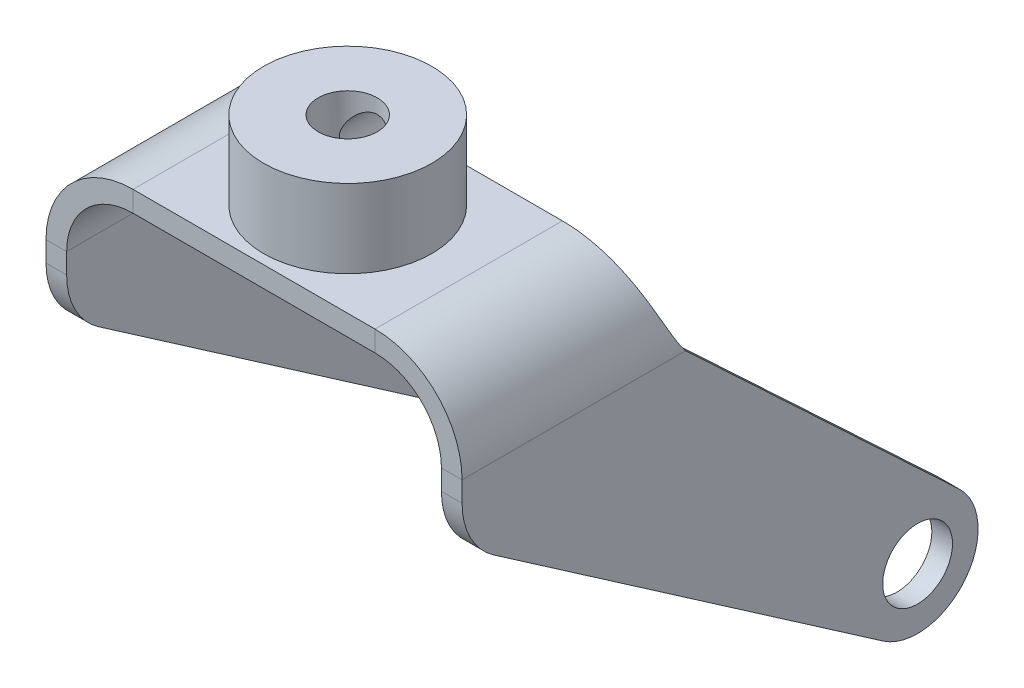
ISO-10303-21;
HEADER;
FILE_DESCRIPTION(('STEP AP214'),'2;1');
FILE_NAME('part.step','',(''),(''),'','','');
FILE_SCHEMA(('AUTOMOTIVE_DESIGN { 1 0 10303 214 1 1 1 1 }'));
ENDSEC;
DATA;
#1=APPLICATION_CONTEXT('core data for automotive mechanical design processes');
#2=APPLICATION_PROTOCOL_DEFINITION('international standard','automotive_design',2000,#1);
#3=PRODUCT_CONTEXT('',#1,'mechanical');
#4=PRODUCT('Part','Part','',(#3));
#5=PRODUCT_RELATED_PRODUCT_CATEGORY('part','',(#4));
#6=PRODUCT_DEFINITION_FORMATION('','',#4);
#7=PRODUCT_DEFINITION_CONTEXT('part definition',#1,'design');
#8=PRODUCT_DEFINITION('design','',#6,#7);
#9=PRODUCT_DEFINITION_SHAPE('','',#8);
#10=(LENGTH_UNIT() NAMED_UNIT(*) SI_UNIT(.MILLI.,.METRE.));
#11=(NAMED_UNIT(*) PLANE_ANGLE_UNIT() SI_UNIT($,.RADIAN.));
#12=(NAMED_UNIT(*) SI_UNIT($,.STERADIAN.) SOLID_ANGLE_UNIT());
#13=UNCERTAINTY_MEASURE_WITH_UNIT(LENGTH_MEASURE(1.E-05),#10,'distance_accuracy_value','');
#14=(GEOMETRIC_REPRESENTATION_CONTEXT(3) GLOBAL_UNCERTAINTY_ASSIGNED_CONTEXT((#13)) GLOBAL_UNIT_ASSIGNED_CONTEXT((#10,
#11,#12)) REPRESENTATION_CONTEXT('',''));
#15=CARTESIAN_POINT('',(0.,0.,0.));
#16=DIRECTION('',(0.,0.,1.));
#17=DIRECTION('',(1.,0.,0.));
#18=AXIS2_PLACEMENT_3D('',#15,#16,#17);
#19=CARTESIAN_POINT('',(-12.7,1.4,6.35));
#20=DIRECTION('',(0.,1.,0.));
#21=DIRECTION('',(0.,0.,1.));
#22=AXIS2_PLACEMENT_3D('',#19,#20,#21);
#23=PLANE('',#22);
#24=DIRECTION('',(1.,0.,0.));
#25=VECTOR('',#24,1.);
#26=CARTESIAN_POINT('',(-12.7,1.4,-6.35));
#27=LINE('',#26,#25);
#28=CARTESIAN_POINT('',(8.2,1.4,-6.35));
#29=VERTEX_POINT('',#28);
#30=CARTESIAN_POINT('',(-8.2,1.4,-6.35));
#31=VERTEX_POINT('',#30);
#32=EDGE_CURVE('E327',#29,#31,#27,.F.);
#33=ORIENTED_EDGE('',*,*,#32,.T.);
#34=DIRECTION('',(0.,0.,1.));
#35=VECTOR('',#34,1.);
#36=CARTESIAN_POINT('',(-8.2,1.4,6.35));
#37=LINE('',#36,#35);
#38=CARTESIAN_POINT('',(-8.2,1.4,6.35));
#39=VERTEX_POINT('',#38);
#40=EDGE_CURVE('E148',#39,#31,#37,.F.);
#41=ORIENTED_EDGE('',*,*,#40,.F.);
#42=DIRECTION('',(1.,0.,0.));
#43=VECTOR('',#42,1.);
#44=CARTESIAN_POINT('',(-12.7,1.4,6.35));
#45=LINE('',#44,#43);
#46=CARTESIAN_POINT('',(8.2,1.4,6.35));
#47=VERTEX_POINT('',#46);
#48=EDGE_CURVE('E329',#39,#47,#45,.T.);
#49=ORIENTED_EDGE('',*,*,#48,.T.);
#50=DIRECTION('',(0.,0.,1.));
#51=VECTOR('',#50,1.);
#52=CARTESIAN_POINT('',(8.2,1.4,6.35));
#53=LINE('',#52,#51);
#54=EDGE_CURVE('E325',#29,#47,#53,.T.);
#55=ORIENTED_EDGE('',*,*,#54,.F.);
#56=EDGE_LOOP('',(#33,#41,#49,#55));
#57=FACE_BOUND('',#56,.T.);
#58=CARTESIAN_POINT('',(0.,1.4,0.));
#59=DIRECTION('',(0.,1.,0.));
#60=DIRECTION('',(0.,0.,1.));
#61=AXIS2_PLACEMENT_3D('',#58,#59,#60);
#62=CIRCLE('',#61,5.7);
#63=CARTESIAN_POINT('',(0.,1.4,5.7));
#64=VERTEX_POINT('',#63);
#65=EDGE_CURVE('E540',#64,#64,#62,.T.);
#66=ORIENTED_EDGE('',*,*,#65,.F.);
#67=EDGE_LOOP('',(#66));
#68=FACE_BOUND('',#67,.T.);
#69=ADVANCED_FACE('F36',(#57,#68),#23,.T.);
#70=CARTESIAN_POINT('',(-12.7,0.,-6.35));
#71=DIRECTION('',(0.,0.,-1.));
#72=DIRECTION('',(-1.,0.,0.));
#73=AXIS2_PLACEMENT_3D('',#70,#71,#72);
#74=PLANE('',#73);
#75=CARTESIAN_POINT('',(-8.2,1.4,-6.35));
#76=CARTESIAN_POINT('',(-8.2,0.,-6.35));
#77=B_SPLINE_CURVE_WITH_KNOTS('',1,(#75,#76),.UNSPECIFIED.,.F.,.F.,(2,2),(0.,1.),.UNSPECIFIED.);
#78=CARTESIAN_POINT('',(-8.2,0.,-6.35));
#79=VERTEX_POINT('',#78);
#80=EDGE_CURVE('E11',#31,#79,#77,.T.);
#81=ORIENTED_EDGE('',*,*,#80,.F.);
#82=ORIENTED_EDGE('',*,*,#32,.F.);
#83=CARTESIAN_POINT('',(8.2,0.,-6.35));
#84=CARTESIAN_POINT('',(8.2,1.4,-6.35));
#85=B_SPLINE_CURVE_WITH_KNOTS('',1,(#83,#84),.UNSPECIFIED.,.F.,.F.,(2,2),(0.,1.),.UNSPECIFIED.);
#86=CARTESIAN_POINT('',(8.2,0.,-6.35));
#87=VERTEX_POINT('',#86);
#88=EDGE_CURVE('E50',#29,#87,#85,.F.);
#89=ORIENTED_EDGE('',*,*,#88,.T.);
#90=DIRECTION('',(-1.,0.,0.));
#91=VECTOR('',#90,1.);
#92=CARTESIAN_POINT('',(-12.7,0.,-6.35));
#93=LINE('',#92,#91);
#94=EDGE_CURVE('E454',#87,#79,#93,.T.);
#95=ORIENTED_EDGE('',*,*,#94,.T.);
#96=EDGE_LOOP('',(#81,#82,#89,#95));
#97=FACE_BOUND('',#96,.T.);
#98=ADVANCED_FACE('F186',(#97),#74,.T.);
#99=CARTESIAN_POINT('',(14.1,-4.5,-8.80259309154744));
#100=CARTESIAN_POINT('',(14.1,-4.24520518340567,-8.59536493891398));
#101=CARTESIAN_POINT('',(14.0833667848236,-3.95543061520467,-8.40151880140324));
#102=CARTESIAN_POINT('',(13.9911021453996,-3.3279520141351,-8.04067228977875));
#103=CARTESIAN_POINT('',(13.915269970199,-2.99020439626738,-7.87361291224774));
#104=CARTESIAN_POINT('',(13.6850177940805,-2.29582818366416,-7.56594962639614));
#105=CARTESIAN_POINT('',(13.5304514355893,-1.9393401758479,-7.42534571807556));
#106=CARTESIAN_POINT('',(13.1351058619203,-1.24186842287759,-7.17032108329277));
#107=CARTESIAN_POINT('',(12.8942854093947,-0.901100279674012,-7.05590035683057));
#108=CARTESIAN_POINT('',(12.3337687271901,-0.269119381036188,-6.8529697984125));
#109=CARTESIAN_POINT('',(12.0141603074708,0.0218727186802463,-6.76445996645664));
#110=CARTESIAN_POINT('',(11.3177211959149,0.52742143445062,-6.61307890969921));
#111=CARTESIAN_POINT('',(10.941085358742,0.741828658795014,-6.55020768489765));
#112=CARTESIAN_POINT('',(10.1621884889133,1.08033448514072,-6.44983155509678));
#113=CARTESIAN_POINT('',(9.76016549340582,1.20440477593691,-6.41232665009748));
#114=CARTESIAN_POINT('',(8.96526323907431,1.36418983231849,-6.36241087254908));
#115=CARTESIAN_POINT('',(8.57248287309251,1.4,-6.35));
#116=CARTESIAN_POINT('',(8.2,1.4,-6.35));
#117=CARTESIAN_POINT('',(12.7,-4.5,-8.80259309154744));
#118=CARTESIAN_POINT('',(12.7,-4.30565265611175,-8.59535180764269));
#119=CARTESIAN_POINT('',(12.6873136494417,-4.0846504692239,-8.40151880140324));
#120=CARTESIAN_POINT('',(12.6169423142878,-3.60606509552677,-8.04067228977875));
#121=CARTESIAN_POINT('',(12.5591042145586,-3.34846098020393,-7.87361291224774));
#122=CARTESIAN_POINT('',(12.3834881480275,-2.81885200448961,-7.56594962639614));
#123=CARTESIAN_POINT('',(12.2655985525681,-2.54695437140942,-7.42534571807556));
#124=CARTESIAN_POINT('',(11.9640637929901,-2.01498439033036,-7.17032108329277));
#125=CARTESIAN_POINT('',(11.7803871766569,-1.75507648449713,-7.05590035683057));
#126=CARTESIAN_POINT('',(11.3528744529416,-1.2730571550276,-6.8529697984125));
#127=CARTESIAN_POINT('',(11.1091053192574,-1.05111402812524,-6.76445996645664));
#128=CARTESIAN_POINT('',(10.5779229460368,-0.665526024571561,-6.61307890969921));
#129=CARTESIAN_POINT('',(10.2906583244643,-0.501995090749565,-6.55020768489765));
#130=CARTESIAN_POINT('',(9.69658444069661,-0.243812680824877,-6.44983155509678));
#131=CARTESIAN_POINT('',(9.38995673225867,-0.149182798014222,-6.41232665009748));
#132=CARTESIAN_POINT('',(8.78367535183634,-0.0273128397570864,-6.36241087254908));
#133=CARTESIAN_POINT('',(8.48409710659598,0.,-6.35));
#134=CARTESIAN_POINT('',(8.2,0.,-6.35));
#135=B_SPLINE_SURFACE_WITH_KNOTS('',1,3,((#99,#100,#101,#102,#103,#104,#105,#106,#107,#108,#109,
#110,#111,#112,#113,#114,#115,#116),(#117,#118,#119,#120,#121,#122,#123,#124,#125,#126,#127,
#128,#129,#130,#131,#132,#133,#134)),.UNSPECIFIED.,.F.,.F.,.F.,(2,2),(4,2,2,2,2,2,2,2,4),(0.,
1.),(0.,0.125,0.25,0.375,0.5,0.625,0.75,0.875,1.),.UNSPECIFIED.);
#136=CARTESIAN_POINT('',(8.2,1.4,-6.35));
#137=CARTESIAN_POINT('',(8.57248287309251,1.4,-6.35));
#138=CARTESIAN_POINT('',(8.96526323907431,1.36418983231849,-6.36241087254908));
#139=CARTESIAN_POINT('',(9.76016549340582,1.20440477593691,-6.41232665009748));
#140=CARTESIAN_POINT('',(10.1621884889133,1.08033448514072,-6.44983155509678));
#141=CARTESIAN_POINT('',(10.941085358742,0.741828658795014,-6.55020768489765));
#142=CARTESIAN_POINT('',(11.3177211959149,0.52742143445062,-6.61307890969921));
#143=CARTESIAN_POINT('',(12.0141603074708,0.0218727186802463,-6.76445996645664));
#144=CARTESIAN_POINT('',(12.3337687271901,-0.269119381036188,-6.8529697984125));
#145=CARTESIAN_POINT('',(12.8942854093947,-0.901100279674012,-7.05590035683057));
#146=CARTESIAN_POINT('',(13.1351058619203,-1.24186842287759,-7.17032108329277));
#147=CARTESIAN_POINT('',(13.5304514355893,-1.9393401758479,-7.42534571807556));
#148=CARTESIAN_POINT('',(13.6850177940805,-2.29582818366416,-7.56594962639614));
#149=CARTESIAN_POINT('',(13.915269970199,-2.99020439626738,-7.87361291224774));
#150=CARTESIAN_POINT('',(13.9911021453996,-3.3279520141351,-8.04067228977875));
#151=CARTESIAN_POINT('',(14.0833667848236,-3.95543061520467,-8.40151880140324));
#152=CARTESIAN_POINT('',(14.1,-4.24520518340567,-8.59536493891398));
#153=CARTESIAN_POINT('',(14.1,-4.5,-8.80259309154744));
#154=B_SPLINE_CURVE_WITH_KNOTS('',3,(#136,#137,#138,#139,#140,#141,#142,#143,#144,#145,#146,
#147,#148,#149,#150,#151,#152,#153),.UNSPECIFIED.,.F.,.F.,(4,2,2,2,2,2,2,2,4),(0.,0.125,0.25,
0.375,0.5,0.625,0.75,0.875,1.),.UNSPECIFIED.);
#155=CARTESIAN_POINT('',(14.1,-4.5,-8.80259309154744));
#156=VERTEX_POINT('',#155);
#157=EDGE_CURVE('E315',#29,#156,#154,.T.);
#158=CARTESIAN_POINT('',(14.1,-4.5,-8.80259309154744));
#159=CARTESIAN_POINT('',(12.7,-4.5,-8.80259309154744));
#160=B_SPLINE_CURVE_WITH_KNOTS('',1,(#158,#159),.UNSPECIFIED.,.F.,.F.,(2,2),(0.,1.),.UNSPECIFIED.);
#161=CARTESIAN_POINT('',(12.7,-4.5,-8.80259309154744));
#162=VERTEX_POINT('',#161);
#163=EDGE_CURVE('E321',#156,#162,#160,.T.);
#164=CARTESIAN_POINT('',(12.7,-4.5,-8.80259309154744));
#165=CARTESIAN_POINT('',(12.7,-4.30565265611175,-8.59535180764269));
#166=CARTESIAN_POINT('',(12.6873136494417,-4.0846504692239,-8.40151880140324));
#167=CARTESIAN_POINT('',(12.6169423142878,-3.60606509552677,-8.04067228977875));
#168=CARTESIAN_POINT('',(12.5591042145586,-3.34846098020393,-7.87361291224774));
#169=CARTESIAN_POINT('',(12.3834881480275,-2.81885200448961,-7.56594962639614));
#170=CARTESIAN_POINT('',(12.2655985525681,-2.54695437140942,-7.42534571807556));
#171=CARTESIAN_POINT('',(11.9640637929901,-2.01498439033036,-7.17032108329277));
#172=CARTESIAN_POINT('',(11.7803871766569,-1.75507648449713,-7.05590035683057));
#173=CARTESIAN_POINT('',(11.3528744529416,-1.2730571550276,-6.8529697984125));
#174=CARTESIAN_POINT('',(11.1091053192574,-1.05111402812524,-6.76445996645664));
#175=CARTESIAN_POINT('',(10.5779229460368,-0.665526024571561,-6.61307890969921));
#176=CARTESIAN_POINT('',(10.2906583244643,-0.501995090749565,-6.55020768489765));
#177=CARTESIAN_POINT('',(9.69658444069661,-0.243812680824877,-6.44983155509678));
#178=CARTESIAN_POINT('',(9.38995673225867,-0.149182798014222,-6.41232665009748));
#179=CARTESIAN_POINT('',(8.78367535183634,-0.0273128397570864,-6.36241087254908));
#180=CARTESIAN_POINT('',(8.48409710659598,0.,-6.35));
#181=CARTESIAN_POINT('',(8.2,0.,-6.35));
#182=B_SPLINE_CURVE_WITH_KNOTS('',3,(#164,#165,#166,#167,#168,#169,#170,#171,#172,#173,#174,
#175,#176,#177,#178,#179,#180,#181),.UNSPECIFIED.,.F.,.F.,(4,2,2,2,2,2,2,2,4),(0.,0.125,0.25,
0.375,0.5,0.625,0.75,0.875,1.),.UNSPECIFIED.);
#183=EDGE_CURVE('E318',#87,#162,#182,.F.);
#184=ORIENTED_EDGE('',*,*,#88,.F.);
#185=ORIENTED_EDGE('',*,*,#157,.T.);
#186=ORIENTED_EDGE('',*,*,#163,.T.);
#187=ORIENTED_EDGE('',*,*,#183,.F.);
#188=EDGE_LOOP('',(#184,#185,#186,#187));
#189=FACE_BOUND('',#188,.T.);
#190=ADVANCED_FACE('F278',(#189),#135,.T.);
#191=CARTESIAN_POINT('',(12.7,-2.2,-6.35));
#192=DIRECTION('',(0.,0.729434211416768,-0.684050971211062));
#193=DIRECTION('',(0.,0.684050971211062,0.729434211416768));
#194=AXIS2_PLACEMENT_3D('',#191,#192,#193);
#195=PLANE('',#194);
#196=ORIENTED_EDGE('',*,*,#163,.F.);
#197=DIRECTION('',(0.,0.684050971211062,0.729434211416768));
#198=VECTOR('',#197,1.);
#199=CARTESIAN_POINT('',(14.1,-2.2,-6.35));
#200=LINE('',#199,#198);
#201=CARTESIAN_POINT('',(14.1,-21.8743197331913,-27.3296089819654));
#202=VERTEX_POINT('',#201);
#203=EDGE_CURVE('E349',#202,#156,#200,.T.);
#204=ORIENTED_EDGE('',*,*,#203,.F.);
#205=DIRECTION('',(-1.,0.,0.));
#206=VECTOR('',#205,1.);
#207=CARTESIAN_POINT('',(12.7,-21.8743197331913,-27.3296089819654));
#208=LINE('',#207,#206);
#209=CARTESIAN_POINT('',(12.7,-21.8743197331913,-27.3296089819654));
#210=VERTEX_POINT('',#209);
#211=EDGE_CURVE('E513',#202,#210,#208,.T.);
#212=ORIENTED_EDGE('',*,*,#211,.T.);
#213=DIRECTION('',(0.,0.684050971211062,0.729434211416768));
#214=VECTOR('',#213,1.);
#215=CARTESIAN_POINT('',(12.7,-2.2,-6.35));
#216=LINE('',#215,#214);
#217=EDGE_CURVE('E408',#210,#162,#216,.T.);
#218=ORIENTED_EDGE('',*,*,#217,.T.);
#219=EDGE_LOOP('',(#196,#204,#212,#218));
#220=FACE_BOUND('',#219,.T.);
#221=ADVANCED_FACE('F274',(#220),#195,.T.);
#222=CARTESIAN_POINT('',(12.7,-24.865,-24.525));
#223=DIRECTION('',(1.,0.,0.));
#224=DIRECTION('',(0.,0.,-1.));
#225=AXIS2_PLACEMENT_3D('',#222,#223,#224);
#226=CYLINDRICAL_SURFACE('',#225,4.09999999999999);
#227=ORIENTED_EDGE('',*,*,#211,.F.);
#228=CARTESIAN_POINT('',(14.1,-24.865,-24.525));
#229=DIRECTION('',(1.,0.,0.));
#230=DIRECTION('',(0.,0.,-1.));
#231=AXIS2_PLACEMENT_3D('',#228,#229,#230);
#232=CIRCLE('',#231,4.09999999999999);
#233=CARTESIAN_POINT('',(14.1,-28.237277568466,-22.1931029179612));
#234=VERTEX_POINT('',#233);
#235=EDGE_CURVE('E344',#234,#202,#232,.T.);
#236=ORIENTED_EDGE('',*,*,#235,.F.);
#237=DIRECTION('',(-1.,0.,0.));
#238=VECTOR('',#237,1.);
#239=CARTESIAN_POINT('',(12.7,-28.237277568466,-22.1931029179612));
#240=LINE('',#239,#238);
#241=CARTESIAN_POINT('',(12.7,-28.237277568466,-22.1931029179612));
#242=VERTEX_POINT('',#241);
#243=EDGE_CURVE('E510',#234,#242,#240,.T.);
#244=ORIENTED_EDGE('',*,*,#243,.T.);
#245=CARTESIAN_POINT('',(12.7,-24.865,-24.525));
#246=DIRECTION('',(1.,0.,0.));
#247=DIRECTION('',(0.,0.,-1.));
#248=AXIS2_PLACEMENT_3D('',#245,#246,#247);
#249=CIRCLE('',#248,4.09999999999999);
#250=EDGE_CURVE('E456',#242,#210,#249,.T.);
#251=ORIENTED_EDGE('',*,*,#250,.T.);
#252=EDGE_LOOP('',(#227,#236,#244,#251));
#253=FACE_BOUND('',#252,.T.);
#254=ADVANCED_FACE('F270',(#253),#226,.T.);
#255=CARTESIAN_POINT('',(12.7,-8.5,6.35));
#256=DIRECTION('',(0.,-0.822506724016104,0.568755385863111));
#257=DIRECTION('',(0.,-0.568755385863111,-0.822506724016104));
#258=AXIS2_PLACEMENT_3D('',#255,#256,#257);
#259=PLANE('',#258);
#260=ORIENTED_EDGE('',*,*,#243,.F.);
#261=DIRECTION('',(0.,-0.568755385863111,-0.822506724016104));
#262=VECTOR('',#261,1.);
#263=CARTESIAN_POINT('',(14.1,-8.5,6.35));
#264=LINE('',#263,#262);
#265=CARTESIAN_POINT('',(14.1,-9.99100724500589,4.19377692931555));
#266=VERTEX_POINT('',#265);
#267=EDGE_CURVE('E604',#266,#234,#264,.T.);
#268=ORIENTED_EDGE('',*,*,#267,.F.);
#269=DIRECTION('',(-1.,0.,0.));
#270=VECTOR('',#269,1.);
#271=CARTESIAN_POINT('',(12.7,-9.99100724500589,4.19377692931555));
#272=LINE('',#271,#270);
#273=CARTESIAN_POINT('',(12.7,-9.99100724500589,4.19377692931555));
#274=VERTEX_POINT('',#273);
#275=EDGE_CURVE('E507',#266,#274,#272,.T.);
#276=ORIENTED_EDGE('',*,*,#275,.T.);
#277=DIRECTION('',(0.,-0.568755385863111,-0.822506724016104));
#278=VECTOR('',#277,1.);
#279=CARTESIAN_POINT('',(12.7,-8.5,6.35));
#280=LINE('',#279,#278);
#281=EDGE_CURVE('E530',#274,#242,#280,.T.);
#282=ORIENTED_EDGE('',*,*,#281,.T.);
#283=EDGE_LOOP('',(#260,#268,#276,#282));
#284=FACE_BOUND('',#283,.T.);
#285=ADVANCED_FACE('F266',(#284),#259,.T.);
#286=CARTESIAN_POINT('',(12.7,-5.87847362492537,1.35));
#287=DIRECTION('',(1.,0.,0.));
#288=DIRECTION('',(0.,0.,-1.));
#289=AXIS2_PLACEMENT_3D('',#286,#287,#288);
#290=CYLINDRICAL_SURFACE('',#289,5.);
#291=ORIENTED_EDGE('',*,*,#275,.F.);
#292=CARTESIAN_POINT('',(14.1,-5.87847362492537,1.35));
#293=DIRECTION('',(1.,0.,0.));
#294=DIRECTION('',(0.,0.,-1.));
#295=AXIS2_PLACEMENT_3D('',#292,#293,#294);
#296=CIRCLE('',#295,5.);
#297=CARTESIAN_POINT('',(14.1,-5.87847362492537,6.35));
#298=VERTEX_POINT('',#297);
#299=EDGE_CURVE('E601',#266,#298,#296,.F.);
#300=ORIENTED_EDGE('',*,*,#299,.T.);
#301=DIRECTION('',(-1.,0.,0.));
#302=VECTOR('',#301,1.);
#303=CARTESIAN_POINT('',(12.7,-5.87847362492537,6.35));
#304=LINE('',#303,#302);
#305=CARTESIAN_POINT('',(12.7,-5.87847362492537,6.35));
#306=VERTEX_POINT('',#305);
#307=EDGE_CURVE('E504',#298,#306,#304,.T.);
#308=ORIENTED_EDGE('',*,*,#307,.T.);
#309=CARTESIAN_POINT('',(12.7,-5.87847362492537,1.35));
#310=DIRECTION('',(1.,0.,0.));
#311=DIRECTION('',(0.,0.,-1.));
#312=AXIS2_PLACEMENT_3D('',#309,#310,#311);
#313=CIRCLE('',#312,5.);
#314=EDGE_CURVE('E527',#274,#306,#313,.F.);
#315=ORIENTED_EDGE('',*,*,#314,.F.);
#316=EDGE_LOOP('',(#291,#300,#308,#315));
#317=FACE_BOUND('',#316,.T.);
#318=ADVANCED_FACE('F262',(#317),#290,.T.);
#319=CARTESIAN_POINT('',(12.7,1.4,6.35));
#320=DIRECTION('',(0.,0.,1.));
#321=DIRECTION('',(0.,-1.,0.));
#322=AXIS2_PLACEMENT_3D('',#319,#320,#321);
#323=PLANE('',#322);
#324=ORIENTED_EDGE('',*,*,#307,.F.);
#325=DIRECTION('',(0.,1.,0.));
#326=VECTOR('',#325,1.);
#327=CARTESIAN_POINT('',(14.1,-24.865,6.35));
#328=LINE('',#327,#326);
#329=CARTESIAN_POINT('',(14.1,-4.5,6.35));
#330=VERTEX_POINT('',#329);
#331=EDGE_CURVE('E598',#330,#298,#328,.F.);
#332=ORIENTED_EDGE('',*,*,#331,.F.);
#333=DIRECTION('',(-1.,0.,0.));
#334=VECTOR('',#333,1.);
#335=CARTESIAN_POINT('',(12.7,-4.5,6.35));
#336=LINE('',#335,#334);
#337=CARTESIAN_POINT('',(12.7,-4.5,6.35));
#338=VERTEX_POINT('',#337);
#339=EDGE_CURVE('E501',#330,#338,#336,.T.);
#340=ORIENTED_EDGE('',*,*,#339,.T.);
#341=DIRECTION('',(0.,-1.,0.));
#342=VECTOR('',#341,1.);
#343=CARTESIAN_POINT('',(12.7,1.4,6.35));
#344=LINE('',#343,#342);
#345=EDGE_CURVE('E466',#338,#306,#344,.T.);
#346=ORIENTED_EDGE('',*,*,#345,.T.);
#347=EDGE_LOOP('',(#324,#332,#340,#346));
#348=FACE_BOUND('',#347,.T.);
#349=ADVANCED_FACE('F258',(#348),#323,.T.);
#350=CARTESIAN_POINT('',(8.2,-4.5,6.35));
#351=DIRECTION('',(0.,0.,1.));
#352=DIRECTION('',(0.,-1.,0.));
#353=AXIS2_PLACEMENT_3D('',#350,#351,#352);
#354=PLANE('',#353);
#355=ORIENTED_EDGE('',*,*,#339,.F.);
#356=CARTESIAN_POINT('',(8.2,-4.5,6.35));
#357=DIRECTION('',(0.,0.,1.));
#358=DIRECTION('',(1.,0.,0.));
#359=AXIS2_PLACEMENT_3D('',#356,#357,#358);
#360=CIRCLE('',#359,5.9);
#361=EDGE_CURVE('E340',#330,#47,#360,.T.);
#362=ORIENTED_EDGE('',*,*,#361,.T.);
#363=DIRECTION('',(0.,-1.,0.));
#364=VECTOR('',#363,1.);
#365=CARTESIAN_POINT('',(8.2,0.,6.35));
#366=LINE('',#365,#364);
#367=CARTESIAN_POINT('',(8.2,0.,6.35));
#368=VERTEX_POINT('',#367);
#369=EDGE_CURVE('E484',#47,#368,#366,.T.);
#370=ORIENTED_EDGE('',*,*,#369,.T.);
#371=CARTESIAN_POINT('',(8.2,-4.5,6.35));
#372=DIRECTION('',(0.,0.,-1.));
#373=DIRECTION('',(0.,1.,0.));
#374=AXIS2_PLACEMENT_3D('',#371,#372,#373);
#375=CIRCLE('',#374,4.5);
#376=EDGE_CURVE('E469',#338,#368,#375,.F.);
#377=ORIENTED_EDGE('',*,*,#376,.F.);
#378=EDGE_LOOP('',(#355,#362,#370,#377));
#379=FACE_BOUND('',#378,.T.);
#380=ADVANCED_FACE('F254',(#379),#354,.T.);
#381=CARTESIAN_POINT('',(-12.7,0.,6.35));
#382=DIRECTION('',(0.,0.,1.));
#383=DIRECTION('',(1.,0.,0.));
#384=AXIS2_PLACEMENT_3D('',#381,#382,#383);
#385=PLANE('',#384);
#386=ORIENTED_EDGE('',*,*,#369,.F.);
#387=ORIENTED_EDGE('',*,*,#48,.F.);
#388=DIRECTION('',(0.,-1.,0.));
#389=VECTOR('',#388,1.);
#390=CARTESIAN_POINT('',(-8.2,0.,6.35));
#391=LINE('',#390,#389);
#392=CARTESIAN_POINT('',(-8.2,0.,6.35));
#393=VERTEX_POINT('',#392);
#394=EDGE_CURVE('E485',#39,#393,#391,.T.);
#395=ORIENTED_EDGE('',*,*,#394,.T.);
#396=DIRECTION('',(1.,0.,0.));
#397=VECTOR('',#396,1.);
#398=CARTESIAN_POINT('',(-12.7,0.,6.35));
#399=LINE('',#398,#397);
#400=EDGE_CURVE('E455',#393,#368,#399,.T.);
#401=ORIENTED_EDGE('',*,*,#400,.T.);
#402=EDGE_LOOP('',(#386,#387,#395,#401));
#403=FACE_BOUND('',#402,.T.);
#404=ADVANCED_FACE('F250',(#403),#385,.T.);
#405=CARTESIAN_POINT('',(-8.2,-4.5,6.35));
#406=DIRECTION('',(0.,0.,1.));
#407=DIRECTION('',(0.,-1.,0.));
#408=AXIS2_PLACEMENT_3D('',#405,#406,#407);
#409=PLANE('',#408);
#410=ORIENTED_EDGE('',*,*,#394,.F.);
#411=CARTESIAN_POINT('',(-8.2,-4.5,6.35));
#412=DIRECTION('',(0.,0.,-1.));
#413=DIRECTION('',(-1.,0.,0.));
#414=AXIS2_PLACEMENT_3D('',#411,#412,#413);
#415=CIRCLE('',#414,5.9);
#416=CARTESIAN_POINT('',(-14.1,-4.5,6.35000000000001));
#417=VERTEX_POINT('',#416);
#418=EDGE_CURVE('E155',#39,#417,#415,.F.);
#419=ORIENTED_EDGE('',*,*,#418,.T.);
#420=DIRECTION('',(1.,0.,0.));
#421=VECTOR('',#420,1.);
#422=CARTESIAN_POINT('',(-12.7,-4.5,6.35000000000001));
#423=LINE('',#422,#421);
#424=CARTESIAN_POINT('',(-12.7,-4.5,6.35000000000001));
#425=VERTEX_POINT('',#424);
#426=EDGE_CURVE('E489',#417,#425,#423,.T.);
#427=ORIENTED_EDGE('',*,*,#426,.T.);
#428=CARTESIAN_POINT('',(-8.2,-4.5,6.35));
#429=DIRECTION('',(0.,0.,-1.));
#430=DIRECTION('',(0.,1.,0.));
#431=AXIS2_PLACEMENT_3D('',#428,#429,#430);
#432=CIRCLE('',#431,4.5);
#433=EDGE_CURVE('E453',#393,#425,#432,.F.);
#434=ORIENTED_EDGE('',*,*,#433,.F.);
#435=EDGE_LOOP('',(#410,#419,#427,#434));
#436=FACE_BOUND('',#435,.T.);
#437=ADVANCED_FACE('F246',(#436),#409,.T.);
#438=CARTESIAN_POINT('',(-12.7,-8.5,6.35000000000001));
#439=DIRECTION('',(0.,0.,1.));
#440=DIRECTION('',(0.,1.,0.));
#441=AXIS2_PLACEMENT_3D('',#438,#439,#440);
#442=PLANE('',#441);
#443=ORIENTED_EDGE('',*,*,#426,.F.);
#444=DIRECTION('',(0.,1.,0.));
#445=VECTOR('',#444,1.);
#446=CARTESIAN_POINT('',(-14.1,-24.865,6.35000000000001));
#447=LINE('',#446,#445);
#448=CARTESIAN_POINT('',(-14.1,-5.87847362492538,6.35000000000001));
#449=VERTEX_POINT('',#448);
#450=EDGE_CURVE('E144',#449,#417,#447,.T.);
#451=ORIENTED_EDGE('',*,*,#450,.F.);
#452=DIRECTION('',(1.,0.,0.));
#453=VECTOR('',#452,1.);
#454=CARTESIAN_POINT('',(-12.7,-5.87847362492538,6.35000000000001));
#455=LINE('',#454,#453);
#456=CARTESIAN_POINT('',(-12.7,-5.87847362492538,6.35000000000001));
#457=VERTEX_POINT('',#456);
#458=EDGE_CURVE('E492',#449,#457,#455,.T.);
#459=ORIENTED_EDGE('',*,*,#458,.T.);
#460=DIRECTION('',(0.,1.,0.));
#461=VECTOR('',#460,1.);
#462=CARTESIAN_POINT('',(-12.7,-8.5,6.35000000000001));
#463=LINE('',#462,#461);
#464=EDGE_CURVE('E648',#457,#425,#463,.T.);
#465=ORIENTED_EDGE('',*,*,#464,.T.);
#466=EDGE_LOOP('',(#443,#451,#459,#465));
#467=FACE_BOUND('',#466,.T.);
#468=ADVANCED_FACE('F242',(#467),#442,.T.);
#469=CARTESIAN_POINT('',(-12.7,-5.87847362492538,1.35));
#470=DIRECTION('',(-1.,0.,0.));
#471=DIRECTION('',(0.,0.,1.));
#472=AXIS2_PLACEMENT_3D('',#469,#470,#471);
#473=CYLINDRICAL_SURFACE('',#472,5.);
#474=ORIENTED_EDGE('',*,*,#458,.F.);
#475=CARTESIAN_POINT('',(-14.1,-5.87847362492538,1.35));
#476=DIRECTION('',(-1.,0.,0.));
#477=DIRECTION('',(0.,0.,1.));
#478=AXIS2_PLACEMENT_3D('',#475,#476,#477);
#479=CIRCLE('',#478,5.);
#480=CARTESIAN_POINT('',(-14.1,-9.9910072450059,4.19377692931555));
#481=VERTEX_POINT('',#480);
#482=EDGE_CURVE('E632',#449,#481,#479,.F.);
#483=ORIENTED_EDGE('',*,*,#482,.T.);
#484=DIRECTION('',(1.,0.,0.));
#485=VECTOR('',#484,1.);
#486=CARTESIAN_POINT('',(-12.7,-9.9910072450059,4.19377692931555));
#487=LINE('',#486,#485);
#488=CARTESIAN_POINT('',(-12.7,-9.9910072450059,4.19377692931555));
#489=VERTEX_POINT('',#488);
#490=EDGE_CURVE('E496',#481,#489,#487,.T.);
#491=ORIENTED_EDGE('',*,*,#490,.T.);
#492=CARTESIAN_POINT('',(-12.7,-5.87847362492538,1.35));
#493=DIRECTION('',(-1.,0.,0.));
#494=DIRECTION('',(0.,0.,1.));
#495=AXIS2_PLACEMENT_3D('',#492,#493,#494);
#496=CIRCLE('',#495,5.);
#497=EDGE_CURVE('E649',#457,#489,#496,.F.);
#498=ORIENTED_EDGE('',*,*,#497,.F.);
#499=EDGE_LOOP('',(#474,#483,#491,#498));
#500=FACE_BOUND('',#499,.T.);
#501=ADVANCED_FACE('F238',(#500),#473,.T.);
#502=CARTESIAN_POINT('',(-12.7,-28.237277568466,-22.1931029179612));
#503=DIRECTION('',(0.,-0.822506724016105,0.568755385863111));
#504=DIRECTION('',(0.,0.568755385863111,0.822506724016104));
#505=AXIS2_PLACEMENT_3D('',#502,#503,#504);
#506=PLANE('',#505);
#507=ORIENTED_EDGE('',*,*,#490,.F.);
#508=DIRECTION('',(0.,0.568755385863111,0.822506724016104));
#509=VECTOR('',#508,1.);
#510=CARTESIAN_POINT('',(-14.1,-28.237277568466,-22.1931029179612));
#511=LINE('',#510,#509);
#512=CARTESIAN_POINT('',(-14.1,-28.237277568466,-22.1931029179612));
#513=VERTEX_POINT('',#512);
#514=EDGE_CURVE('E163',#513,#481,#511,.T.);
#515=ORIENTED_EDGE('',*,*,#514,.F.);
#516=DIRECTION('',(1.,0.,0.));
#517=VECTOR('',#516,1.);
#518=CARTESIAN_POINT('',(-12.7,-28.237277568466,-22.1931029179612));
#519=LINE('',#518,#517);
#520=CARTESIAN_POINT('',(-12.7,-28.237277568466,-22.1931029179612));
#521=VERTEX_POINT('',#520);
#522=EDGE_CURVE('E659',#513,#521,#519,.T.);
#523=ORIENTED_EDGE('',*,*,#522,.T.);
#524=DIRECTION('',(0.,0.568755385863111,0.822506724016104));
#525=VECTOR('',#524,1.);
#526=CARTESIAN_POINT('',(-12.7,-28.237277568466,-22.1931029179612));
#527=LINE('',#526,#525);
#528=EDGE_CURVE('E651',#521,#489,#527,.T.);
#529=ORIENTED_EDGE('',*,*,#528,.T.);
#530=EDGE_LOOP('',(#507,#515,#523,#529));
#531=FACE_BOUND('',#530,.T.);
#532=ADVANCED_FACE('F234',(#531),#506,.T.);
#533=CARTESIAN_POINT('',(-12.7,-24.865,-24.525));
#534=DIRECTION('',(-1.,0.,0.));
#535=DIRECTION('',(0.,0.,1.));
#536=AXIS2_PLACEMENT_3D('',#533,#534,#535);
#537=CYLINDRICAL_SURFACE('',#536,4.09999999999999);
#538=ORIENTED_EDGE('',*,*,#522,.F.);
#539=CARTESIAN_POINT('',(-14.1,-24.865,-24.525));
#540=DIRECTION('',(-1.,0.,0.));
#541=DIRECTION('',(0.,0.,1.));
#542=AXIS2_PLACEMENT_3D('',#539,#540,#541);
#543=CIRCLE('',#542,4.09999999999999);
#544=CARTESIAN_POINT('',(-14.1,-21.8743197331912,-27.3296089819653));
#545=VERTEX_POINT('',#544);
#546=EDGE_CURVE('E161',#545,#513,#543,.T.);
#547=ORIENTED_EDGE('',*,*,#546,.F.);
#548=DIRECTION('',(1.,0.,0.));
#549=VECTOR('',#548,1.);
#550=CARTESIAN_POINT('',(-12.7,-21.8743197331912,-27.3296089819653));
#551=LINE('',#550,#549);
#552=CARTESIAN_POINT('',(-12.7,-21.8743197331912,-27.3296089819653));
#553=VERTEX_POINT('',#552);
#554=EDGE_CURVE('E131',#545,#553,#551,.T.);
#555=ORIENTED_EDGE('',*,*,#554,.T.);
#556=CARTESIAN_POINT('',(-12.7,-24.865,-24.525));
#557=DIRECTION('',(-1.,0.,0.));
#558=DIRECTION('',(0.,0.,1.));
#559=AXIS2_PLACEMENT_3D('',#556,#557,#558);
#560=CIRCLE('',#559,4.09999999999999);
#561=EDGE_CURVE('E443',#553,#521,#560,.T.);
#562=ORIENTED_EDGE('',*,*,#561,.T.);
#563=EDGE_LOOP('',(#538,#547,#555,#562));
#564=FACE_BOUND('',#563,.T.);
#565=ADVANCED_FACE('F230',(#564),#537,.T.);
#566=CARTESIAN_POINT('',(-12.7,-2.2,-6.34999999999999));
#567=DIRECTION('',(0.,0.729434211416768,-0.684050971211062));
#568=DIRECTION('',(0.,-0.684050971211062,-0.729434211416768));
#569=AXIS2_PLACEMENT_3D('',#566,#567,#568);
#570=PLANE('',#569);
#571=ORIENTED_EDGE('',*,*,#554,.F.);
#572=DIRECTION('',(0.,-0.684050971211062,-0.729434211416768));
#573=VECTOR('',#572,1.);
#574=CARTESIAN_POINT('',(-14.1,-2.2,-6.34999999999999));
#575=LINE('',#574,#573);
#576=CARTESIAN_POINT('',(-14.1,-4.5,-8.80259309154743));
#577=VERTEX_POINT('',#576);
#578=EDGE_CURVE('E141',#577,#545,#575,.T.);
#579=ORIENTED_EDGE('',*,*,#578,.F.);
#580=CARTESIAN_POINT('',(-12.7,-4.5,-8.80259309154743));
#581=CARTESIAN_POINT('',(-14.1,-4.5,-8.80259309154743));
#582=B_SPLINE_CURVE_WITH_KNOTS('',1,(#580,#581),.UNSPECIFIED.,.F.,.F.,(2,2),(0.,1.),.UNSPECIFIED.);
#583=CARTESIAN_POINT('',(-12.7,-4.5,-8.80259309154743));
#584=VERTEX_POINT('',#583);
#585=EDGE_CURVE('E115',#577,#584,#582,.F.);
#586=ORIENTED_EDGE('',*,*,#585,.T.);
#587=DIRECTION('',(0.,-0.684050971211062,-0.729434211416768));
#588=VECTOR('',#587,1.);
#589=CARTESIAN_POINT('',(-12.7,-2.2,-6.34999999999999));
#590=LINE('',#589,#588);
#591=EDGE_CURVE('E437',#584,#553,#590,.T.);
#592=ORIENTED_EDGE('',*,*,#591,.T.);
#593=EDGE_LOOP('',(#571,#579,#586,#592));
#594=FACE_BOUND('',#593,.T.);
#595=ADVANCED_FACE('F158',(#594),#570,.T.);
#596=CARTESIAN_POINT('',(12.7,-24.865,-24.525));
#597=DIRECTION('',(1.,0.,0.));
#598=DIRECTION('',(0.,0.,-1.));
#599=AXIS2_PLACEMENT_3D('',#596,#597,#598);
#600=CYLINDRICAL_SURFACE('',#599,2.365);
#601=CARTESIAN_POINT('',(12.7,-24.865,-24.525));
#602=DIRECTION('',(1.,0.,0.));
#603=DIRECTION('',(0.,0.,-1.));
#604=AXIS2_PLACEMENT_3D('',#601,#602,#603);
#605=CIRCLE('',#604,2.365);
#606=CARTESIAN_POINT('',(12.7,-24.865,-26.89));
#607=VERTEX_POINT('',#606);
#608=EDGE_CURVE('E452',#607,#607,#605,.T.);
#609=ORIENTED_EDGE('',*,*,#608,.F.);
#610=EDGE_LOOP('',(#609));
#611=FACE_BOUND('',#610,.T.);
#612=CARTESIAN_POINT('',(14.1,-24.865,-24.525));
#613=DIRECTION('',(1.,0.,0.));
#614=DIRECTION('',(0.,0.,-1.));
#615=AXIS2_PLACEMENT_3D('',#612,#613,#614);
#616=CIRCLE('',#615,2.365);
#617=CARTESIAN_POINT('',(14.1,-24.865,-26.89));
#618=VERTEX_POINT('',#617);
#619=EDGE_CURVE('E154',#618,#618,#616,.T.);
#620=ORIENTED_EDGE('',*,*,#619,.T.);
#621=EDGE_LOOP('',(#620));
#622=FACE_BOUND('',#621,.T.);
#623=ADVANCED_FACE('F38',(#611,#622),#600,.F.);
#624=CARTESIAN_POINT('',(-12.7,-24.865,-24.525));
#625=DIRECTION('',(-1.,0.,0.));
#626=DIRECTION('',(0.,0.,1.));
#627=AXIS2_PLACEMENT_3D('',#624,#625,#626);
#628=CYLINDRICAL_SURFACE('',#627,2.365);
#629=CARTESIAN_POINT('',(-12.7,-24.865,-24.525));
#630=DIRECTION('',(-1.,0.,0.));
#631=DIRECTION('',(0.,0.,1.));
#632=AXIS2_PLACEMENT_3D('',#629,#630,#631);
#633=CIRCLE('',#632,2.365);
#634=CARTESIAN_POINT('',(-12.7,-24.865,-22.16));
#635=VERTEX_POINT('',#634);
#636=EDGE_CURVE('E459',#635,#635,#633,.T.);
#637=ORIENTED_EDGE('',*,*,#636,.F.);
#638=EDGE_LOOP('',(#637));
#639=FACE_BOUND('',#638,.T.);
#640=CARTESIAN_POINT('',(-14.1,-24.865,-24.525));
#641=DIRECTION('',(-1.,0.,0.));
#642=DIRECTION('',(0.,0.,1.));
#643=AXIS2_PLACEMENT_3D('',#640,#641,#642);
#644=CIRCLE('',#643,2.365);
#645=CARTESIAN_POINT('',(-14.1,-24.865,-22.16));
#646=VERTEX_POINT('',#645);
#647=EDGE_CURVE('E346',#646,#646,#644,.T.);
#648=ORIENTED_EDGE('',*,*,#647,.T.);
#649=EDGE_LOOP('',(#648));
#650=FACE_BOUND('',#649,.T.);
#651=ADVANCED_FACE('F184',(#639,#650),#628,.F.);
#652=CARTESIAN_POINT('',(-8.2,1.4,-6.35));
#653=CARTESIAN_POINT('',(-8.57248287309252,1.4,-6.35));
#654=CARTESIAN_POINT('',(-8.96526323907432,1.36418983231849,-6.36241087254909));
#655=CARTESIAN_POINT('',(-9.76016549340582,1.20440477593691,-6.41232665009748));
#656=CARTESIAN_POINT('',(-10.1621884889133,1.08033448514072,-6.44983155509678));
#657=CARTESIAN_POINT('',(-10.941085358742,0.741828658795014,-6.55020768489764));
#658=CARTESIAN_POINT('',(-11.3177211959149,0.52742143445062,-6.61307890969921));
#659=CARTESIAN_POINT('',(-12.0141603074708,0.0218727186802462,-6.76445996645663));
#660=CARTESIAN_POINT('',(-12.3337687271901,-0.269119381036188,-6.85296979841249));
#661=CARTESIAN_POINT('',(-12.8942854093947,-0.901100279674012,-7.05590035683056));
#662=CARTESIAN_POINT('',(-13.1351058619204,-1.24186842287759,-7.17032108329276));
#663=CARTESIAN_POINT('',(-13.5304514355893,-1.9393401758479,-7.42534571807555));
#664=CARTESIAN_POINT('',(-13.6850177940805,-2.29582818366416,-7.56594962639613));
#665=CARTESIAN_POINT('',(-13.915269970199,-2.99020439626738,-7.87361291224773));
#666=CARTESIAN_POINT('',(-13.9911021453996,-3.3279520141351,-8.04067228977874));
#667=CARTESIAN_POINT('',(-14.0833667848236,-3.95543061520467,-8.40151880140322));
#668=CARTESIAN_POINT('',(-14.1,-4.24520518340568,-8.59536493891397));
#669=CARTESIAN_POINT('',(-14.1,-4.5,-8.80259309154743));
#670=CARTESIAN_POINT('',(-8.2,0.,-6.35));
#671=CARTESIAN_POINT('',(-8.48409710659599,0.,-6.35));
#672=CARTESIAN_POINT('',(-8.78367535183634,-0.0273128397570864,-6.36241087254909));
#673=CARTESIAN_POINT('',(-9.38995673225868,-0.149182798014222,-6.41232665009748));
#674=CARTESIAN_POINT('',(-9.69658444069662,-0.243812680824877,-6.44983155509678));
#675=CARTESIAN_POINT('',(-10.2906583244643,-0.501995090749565,-6.55020768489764));
#676=CARTESIAN_POINT('',(-10.5779229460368,-0.665526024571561,-6.61307890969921));
#677=CARTESIAN_POINT('',(-11.1091053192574,-1.05111402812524,-6.76445996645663));
#678=CARTESIAN_POINT('',(-11.3528744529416,-1.2730571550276,-6.85296979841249));
#679=CARTESIAN_POINT('',(-11.780387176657,-1.75507648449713,-7.05590035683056));
#680=CARTESIAN_POINT('',(-11.9640637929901,-2.01498439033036,-7.17032108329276));
#681=CARTESIAN_POINT('',(-12.2655985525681,-2.54695437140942,-7.42534571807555));
#682=CARTESIAN_POINT('',(-12.3834881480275,-2.81885200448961,-7.56594962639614));
#683=CARTESIAN_POINT('',(-12.5591042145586,-3.34846098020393,-7.87361291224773));
#684=CARTESIAN_POINT('',(-12.6169423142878,-3.60606509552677,-8.04067228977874));
#685=CARTESIAN_POINT('',(-12.6873136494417,-4.0846504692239,-8.40151880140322));
#686=CARTESIAN_POINT('',(-12.7,-4.30565265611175,-8.59535180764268));
#687=CARTESIAN_POINT('',(-12.7,-4.5,-8.80259309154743));
#688=B_SPLINE_SURFACE_WITH_KNOTS('',1,3,((#652,#653,#654,#655,#656,#657,#658,#659,#660,#661,
#662,#663,#664,#665,#666,#667,#668,#669),(#670,#671,#672,#673,#674,#675,#676,#677,#678,#679,
#680,#681,#682,#683,#684,#685,#686,#687)),.UNSPECIFIED.,.F.,.F.,.F.,(2,2),(4,2,2,2,2,2,2,2,4),
(0.,1.),(0.,0.125,0.25,0.375,0.5,0.625,0.75,0.875,1.),.UNSPECIFIED.);
#689=CARTESIAN_POINT('',(-14.1,-4.5,-8.80259309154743));
#690=CARTESIAN_POINT('',(-14.1,-4.24520518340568,-8.59536493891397));
#691=CARTESIAN_POINT('',(-14.0833667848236,-3.95543061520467,-8.40151880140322));
#692=CARTESIAN_POINT('',(-13.9911021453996,-3.3279520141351,-8.04067228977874));
#693=CARTESIAN_POINT('',(-13.915269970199,-2.99020439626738,-7.87361291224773));
#694=CARTESIAN_POINT('',(-13.6850177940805,-2.29582818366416,-7.56594962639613));
#695=CARTESIAN_POINT('',(-13.5304514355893,-1.9393401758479,-7.42534571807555));
#696=CARTESIAN_POINT('',(-13.1351058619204,-1.24186842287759,-7.17032108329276));
#697=CARTESIAN_POINT('',(-12.8942854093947,-0.901100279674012,-7.05590035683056));
#698=CARTESIAN_POINT('',(-12.3337687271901,-0.269119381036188,-6.85296979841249));
#699=CARTESIAN_POINT('',(-12.0141603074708,0.0218727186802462,-6.76445996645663));
#700=CARTESIAN_POINT('',(-11.3177211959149,0.52742143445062,-6.61307890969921));
#701=CARTESIAN_POINT('',(-10.941085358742,0.741828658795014,-6.55020768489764));
#702=CARTESIAN_POINT('',(-10.1621884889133,1.08033448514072,-6.44983155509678));
#703=CARTESIAN_POINT('',(-9.76016549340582,1.20440477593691,-6.41232665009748));
#704=CARTESIAN_POINT('',(-8.96526323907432,1.36418983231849,-6.36241087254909));
#705=CARTESIAN_POINT('',(-8.57248287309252,1.4,-6.35));
#706=CARTESIAN_POINT('',(-8.2,1.4,-6.35));
#707=B_SPLINE_CURVE_WITH_KNOTS('',3,(#689,#690,#691,#692,#693,#694,#695,#696,#697,#698,#699,
#700,#701,#702,#703,#704,#705,#706),.UNSPECIFIED.,.F.,.F.,(4,2,2,2,2,2,2,2,4),(0.,0.125,0.25,
0.375,0.5,0.625,0.75,0.875,1.),.UNSPECIFIED.);
#708=EDGE_CURVE('E120',#577,#31,#707,.T.);
#709=CARTESIAN_POINT('',(-8.2,0.,-6.35));
#710=CARTESIAN_POINT('',(-8.48409710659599,0.,-6.35));
#711=CARTESIAN_POINT('',(-8.78367535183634,-0.0273128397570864,-6.36241087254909));
#712=CARTESIAN_POINT('',(-9.38995673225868,-0.149182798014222,-6.41232665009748));
#713=CARTESIAN_POINT('',(-9.69658444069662,-0.243812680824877,-6.44983155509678));
#714=CARTESIAN_POINT('',(-10.2906583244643,-0.501995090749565,-6.55020768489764));
#715=CARTESIAN_POINT('',(-10.5779229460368,-0.665526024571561,-6.61307890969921));
#716=CARTESIAN_POINT('',(-11.1091053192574,-1.05111402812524,-6.76445996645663));
#717=CARTESIAN_POINT('',(-11.3528744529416,-1.2730571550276,-6.85296979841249));
#718=CARTESIAN_POINT('',(-11.780387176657,-1.75507648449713,-7.05590035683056));
#719=CARTESIAN_POINT('',(-11.9640637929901,-2.01498439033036,-7.17032108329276));
#720=CARTESIAN_POINT('',(-12.2655985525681,-2.54695437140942,-7.42534571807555));
#721=CARTESIAN_POINT('',(-12.3834881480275,-2.81885200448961,-7.56594962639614));
#722=CARTESIAN_POINT('',(-12.5591042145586,-3.34846098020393,-7.87361291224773));
#723=CARTESIAN_POINT('',(-12.6169423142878,-3.60606509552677,-8.04067228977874));
#724=CARTESIAN_POINT('',(-12.6873136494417,-4.0846504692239,-8.40151880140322));
#725=CARTESIAN_POINT('',(-12.7,-4.30565265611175,-8.59535180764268));
#726=CARTESIAN_POINT('',(-12.7,-4.5,-8.80259309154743));
#727=B_SPLINE_CURVE_WITH_KNOTS('',3,(#709,#710,#711,#712,#713,#714,#715,#716,#717,#718,#719,
#720,#721,#722,#723,#724,#725,#726),.UNSPECIFIED.,.F.,.F.,(4,2,2,2,2,2,2,2,4),(0.,0.125,0.25,
0.375,0.5,0.625,0.75,0.875,1.),.UNSPECIFIED.);
#728=EDGE_CURVE('E124',#584,#79,#727,.F.);
#729=ORIENTED_EDGE('',*,*,#708,.T.);
#730=ORIENTED_EDGE('',*,*,#80,.T.);
#731=ORIENTED_EDGE('',*,*,#728,.F.);
#732=ORIENTED_EDGE('',*,*,#585,.F.);
#733=EDGE_LOOP('',(#729,#730,#731,#732));
#734=FACE_BOUND('',#733,.T.);
#735=ADVANCED_FACE('F118',(#734),#688,.T.);
#736=CARTESIAN_POINT('',(-12.7,-24.865,-24.525));
#737=DIRECTION('',(-1.,0.,0.));
#738=DIRECTION('',(0.,0.,1.));
#739=AXIS2_PLACEMENT_3D('',#736,#737,#738);
#740=PLANE('',#739);
#741=ORIENTED_EDGE('',*,*,#636,.T.);
#742=EDGE_LOOP('',(#741));
#743=FACE_BOUND('',#742,.T.);
#744=ORIENTED_EDGE('',*,*,#591,.F.);
#745=DIRECTION('',(0.,0.,1.));
#746=VECTOR('',#745,1.);
#747=CARTESIAN_POINT('',(-12.7,-4.5,6.35000000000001));
#748=LINE('',#747,#746);
#749=EDGE_CURVE('E432',#584,#425,#748,.T.);
#750=ORIENTED_EDGE('',*,*,#749,.T.);
#751=ORIENTED_EDGE('',*,*,#464,.F.);
#752=ORIENTED_EDGE('',*,*,#497,.T.);
#753=ORIENTED_EDGE('',*,*,#528,.F.);
#754=ORIENTED_EDGE('',*,*,#561,.F.);
#755=EDGE_LOOP('',(#744,#750,#751,#752,#753,#754));
#756=FACE_BOUND('',#755,.T.);
#757=ADVANCED_FACE('F183',(#743,#756),#740,.F.);
#758=CARTESIAN_POINT('',(-12.7,0.,6.35));
#759=DIRECTION('',(0.,1.,0.));
#760=DIRECTION('',(0.,0.,1.));
#761=AXIS2_PLACEMENT_3D('',#758,#759,#760);
#762=PLANE('',#761);
#763=CARTESIAN_POINT('',(0.,0.,0.));
#764=DIRECTION('',(0.,1.,0.));
#765=DIRECTION('',(0.,0.,1.));
#766=AXIS2_PLACEMENT_3D('',#763,#764,#765);
#767=CIRCLE('',#766,2.);
#768=CARTESIAN_POINT('',(0.,0.,2.));
#769=VERTEX_POINT('',#768);
#770=EDGE_CURVE('E543',#769,#769,#767,.T.);
#771=ORIENTED_EDGE('',*,*,#770,.T.);
#772=EDGE_LOOP('',(#771));
#773=FACE_BOUND('',#772,.T.);
#774=ORIENTED_EDGE('',*,*,#94,.F.);
#775=DIRECTION('',(0.,0.,-1.));
#776=VECTOR('',#775,1.);
#777=CARTESIAN_POINT('',(8.2,0.,6.35));
#778=LINE('',#777,#776);
#779=EDGE_CURVE('E132',#87,#368,#778,.F.);
#780=ORIENTED_EDGE('',*,*,#779,.T.);
#781=ORIENTED_EDGE('',*,*,#400,.F.);
#782=DIRECTION('',(0.,0.,1.));
#783=VECTOR('',#782,1.);
#784=CARTESIAN_POINT('',(-8.2,0.,-6.35));
#785=LINE('',#784,#783);
#786=EDGE_CURVE('E379',#393,#79,#785,.F.);
#787=ORIENTED_EDGE('',*,*,#786,.T.);
#788=EDGE_LOOP('',(#774,#780,#781,#787));
#789=FACE_BOUND('',#788,.T.);
#790=ADVANCED_FACE('F486',(#773,#789),#762,.F.);
#791=CARTESIAN_POINT('',(12.7,-24.865,-24.525));
#792=DIRECTION('',(1.,0.,0.));
#793=DIRECTION('',(0.,0.,-1.));
#794=AXIS2_PLACEMENT_3D('',#791,#792,#793);
#795=PLANE('',#794);
#796=ORIENTED_EDGE('',*,*,#608,.T.);
#797=EDGE_LOOP('',(#796));
#798=FACE_BOUND('',#797,.T.);
#799=ORIENTED_EDGE('',*,*,#345,.F.);
#800=DIRECTION('',(0.,0.,-1.));
#801=VECTOR('',#800,1.);
#802=CARTESIAN_POINT('',(12.7,-4.5,-6.35));
#803=LINE('',#802,#801);
#804=EDGE_CURVE('E423',#338,#162,#803,.T.);
#805=ORIENTED_EDGE('',*,*,#804,.T.);
#806=ORIENTED_EDGE('',*,*,#217,.F.);
#807=ORIENTED_EDGE('',*,*,#250,.F.);
#808=ORIENTED_EDGE('',*,*,#281,.F.);
#809=ORIENTED_EDGE('',*,*,#314,.T.);
#810=EDGE_LOOP('',(#799,#805,#806,#807,#808,#809));
#811=FACE_BOUND('',#810,.T.);
#812=ADVANCED_FACE('F392',(#798,#811),#795,.F.);
#813=CARTESIAN_POINT('',(-8.20000000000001,-4.5,-24.525));
#814=DIRECTION('',(0.,0.,-1.));
#815=DIRECTION('',(-1.,0.,0.));
#816=AXIS2_PLACEMENT_3D('',#813,#814,#815);
#817=CYLINDRICAL_SURFACE('',#816,4.5);
#818=ORIENTED_EDGE('',*,*,#728,.T.);
#819=ORIENTED_EDGE('',*,*,#786,.F.);
#820=ORIENTED_EDGE('',*,*,#433,.T.);
#821=ORIENTED_EDGE('',*,*,#749,.F.);
#822=EDGE_LOOP('',(#818,#819,#820,#821));
#823=FACE_BOUND('',#822,.T.);
#824=ADVANCED_FACE('F382',(#823),#817,.F.);
#825=CARTESIAN_POINT('',(8.19999999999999,-4.5,-24.525));
#826=DIRECTION('',(0.,0.,1.));
#827=DIRECTION('',(1.,0.,0.));
#828=AXIS2_PLACEMENT_3D('',#825,#826,#827);
#829=CYLINDRICAL_SURFACE('',#828,4.5);
#830=ORIENTED_EDGE('',*,*,#376,.T.);
#831=ORIENTED_EDGE('',*,*,#779,.F.);
#832=ORIENTED_EDGE('',*,*,#183,.T.);
#833=ORIENTED_EDGE('',*,*,#804,.F.);
#834=EDGE_LOOP('',(#830,#831,#832,#833));
#835=FACE_BOUND('',#834,.T.);
#836=ADVANCED_FACE('F185',(#835),#829,.F.);
#837=CARTESIAN_POINT('',(-14.1,-24.865,-24.525));
#838=DIRECTION('',(-1.,0.,0.));
#839=DIRECTION('',(0.,0.,1.));
#840=AXIS2_PLACEMENT_3D('',#837,#838,#839);
#841=PLANE('',#840);
#842=ORIENTED_EDGE('',*,*,#647,.F.);
#843=EDGE_LOOP('',(#842));
#844=FACE_BOUND('',#843,.T.);
#845=ORIENTED_EDGE('',*,*,#578,.T.);
#846=ORIENTED_EDGE('',*,*,#546,.T.);
#847=ORIENTED_EDGE('',*,*,#514,.T.);
#848=ORIENTED_EDGE('',*,*,#482,.F.);
#849=ORIENTED_EDGE('',*,*,#450,.T.);
#850=DIRECTION('',(0.,0.,1.));
#851=VECTOR('',#850,1.);
#852=CARTESIAN_POINT('',(-14.1,-4.5,-24.525));
#853=LINE('',#852,#851);
#854=EDGE_CURVE('E138',#577,#417,#853,.T.);
#855=ORIENTED_EDGE('',*,*,#854,.F.);
#856=EDGE_LOOP('',(#845,#846,#847,#848,#849,#855));
#857=FACE_BOUND('',#856,.T.);
#858=ADVANCED_FACE('F139',(#844,#857),#841,.T.);
#859=CARTESIAN_POINT('',(14.1,-24.865,-24.525));
#860=DIRECTION('',(1.,0.,0.));
#861=DIRECTION('',(0.,0.,-1.));
#862=AXIS2_PLACEMENT_3D('',#859,#860,#861);
#863=PLANE('',#862);
#864=ORIENTED_EDGE('',*,*,#619,.F.);
#865=EDGE_LOOP('',(#864));
#866=FACE_BOUND('',#865,.T.);
#867=ORIENTED_EDGE('',*,*,#331,.T.);
#868=ORIENTED_EDGE('',*,*,#299,.F.);
#869=ORIENTED_EDGE('',*,*,#267,.T.);
#870=ORIENTED_EDGE('',*,*,#235,.T.);
#871=ORIENTED_EDGE('',*,*,#203,.T.);
#872=DIRECTION('',(0.,0.,-1.));
#873=VECTOR('',#872,1.);
#874=CARTESIAN_POINT('',(14.1,-4.5,-24.525));
#875=LINE('',#874,#873);
#876=EDGE_CURVE('E333',#330,#156,#875,.T.);
#877=ORIENTED_EDGE('',*,*,#876,.F.);
#878=EDGE_LOOP('',(#867,#868,#869,#870,#871,#877));
#879=FACE_BOUND('',#878,.T.);
#880=ADVANCED_FACE('F584',(#866,#879),#863,.T.);
#881=CARTESIAN_POINT('',(-8.20000000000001,-4.5,-24.525));
#882=DIRECTION('',(0.,0.,-1.));
#883=DIRECTION('',(-1.,0.,0.));
#884=AXIS2_PLACEMENT_3D('',#881,#882,#883);
#885=CYLINDRICAL_SURFACE('',#884,5.9);
#886=ORIENTED_EDGE('',*,*,#708,.F.);
#887=ORIENTED_EDGE('',*,*,#854,.T.);
#888=ORIENTED_EDGE('',*,*,#418,.F.);
#889=ORIENTED_EDGE('',*,*,#40,.T.);
#890=EDGE_LOOP('',(#886,#887,#888,#889));
#891=FACE_BOUND('',#890,.T.);
#892=ADVANCED_FACE('F151',(#891),#885,.T.);
#893=CARTESIAN_POINT('',(8.19999999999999,-4.5,-24.525));
#894=DIRECTION('',(0.,0.,1.));
#895=DIRECTION('',(1.,0.,0.));
#896=AXIS2_PLACEMENT_3D('',#893,#894,#895);
#897=CYLINDRICAL_SURFACE('',#896,5.9);
#898=ORIENTED_EDGE('',*,*,#361,.F.);
#899=ORIENTED_EDGE('',*,*,#876,.T.);
#900=ORIENTED_EDGE('',*,*,#157,.F.);
#901=ORIENTED_EDGE('',*,*,#54,.T.);
#902=EDGE_LOOP('',(#898,#899,#900,#901));
#903=FACE_BOUND('',#902,.T.);
#904=ADVANCED_FACE('F337',(#903),#897,.T.);
#905=CARTESIAN_POINT('',(0.,6.7,0.));
#906=DIRECTION('',(0.,-1.,0.));
#907=DIRECTION('',(0.,0.,-1.));
#908=AXIS2_PLACEMENT_3D('',#905,#906,#907);
#909=CYLINDRICAL_SURFACE('',#908,5.7);
#910=CARTESIAN_POINT('',(0.,5.72,-5.7));
#911=CARTESIAN_POINT('',(-0.0917128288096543,5.71999862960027,-5.69999905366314));
#912=CARTESIAN_POINT('',(-0.183439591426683,5.71241987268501,-5.6977652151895));
#913=CARTESIAN_POINT('',(-0.364228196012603,5.68237298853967,-5.68907192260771));
#914=CARTESIAN_POINT('',(-0.453289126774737,5.6598998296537,-5.68261104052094));
#915=CARTESIAN_POINT('',(-0.626111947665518,5.60087433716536,-5.66617274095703));
#916=CARTESIAN_POINT('',(-0.70988124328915,5.56434221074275,-5.65620037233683));
#917=CARTESIAN_POINT('',(-0.87010518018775,5.47831694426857,-5.63377938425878));
#918=CARTESIAN_POINT('',(-0.946558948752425,5.42882226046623,-5.62133046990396));
#919=CARTESIAN_POINT('',(-1.09208498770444,5.31684134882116,-5.59490483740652));
#920=CARTESIAN_POINT('',(-1.16092750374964,5.25406368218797,-5.58089791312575));
#921=CARTESIAN_POINT('',(-1.28727357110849,5.11792036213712,-5.553118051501));
#922=CARTESIAN_POINT('',(-1.34477531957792,5.04455302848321,-5.53934515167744));
#923=CARTESIAN_POINT('',(-1.44799687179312,4.88739327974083,-5.51327558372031));
#924=CARTESIAN_POINT('',(-1.4934398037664,4.8034121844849,-5.50101658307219));
#925=CARTESIAN_POINT('',(-1.56946540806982,4.62858318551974,-5.47981269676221));
#926=CARTESIAN_POINT('',(-1.60005146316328,4.53773685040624,-5.4708670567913));
#927=CARTESIAN_POINT('',(-1.64467328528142,4.35432875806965,-5.45761689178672));
#928=CARTESIAN_POINT('',(-1.65913113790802,4.26187844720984,-5.45319426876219));
#929=CARTESIAN_POINT('',(-1.67240375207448,4.07576683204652,-5.44913920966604));
#930=CARTESIAN_POINT('',(-1.6712221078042,3.98210581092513,-5.44950567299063));
#931=CARTESIAN_POINT('',(-1.6535815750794,3.79963269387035,-5.45488248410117));
#932=CARTESIAN_POINT('',(-1.63764739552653,3.7107644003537,-5.45973332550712));
#933=CARTESIAN_POINT('',(-1.59180024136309,3.53702203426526,-5.47327485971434));
#934=CARTESIAN_POINT('',(-1.56188594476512,3.45214834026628,-5.48196591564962));
#935=CARTESIAN_POINT('',(-1.48853238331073,3.28750263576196,-5.50233870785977));
#936=CARTESIAN_POINT('',(-1.44491995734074,3.20781266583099,-5.51405837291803));
#937=CARTESIAN_POINT('',(-1.34552856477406,3.05670455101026,-5.53914917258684));
#938=CARTESIAN_POINT('',(-1.28974676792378,2.98528833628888,-5.55252069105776));
#939=CARTESIAN_POINT('',(-1.16497719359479,2.84977391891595,-5.5800592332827));
#940=CARTESIAN_POINT('',(-1.09555279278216,2.78607918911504,-5.59423675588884));
#941=CARTESIAN_POINT('',(-0.946831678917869,2.67114468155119,-5.62131787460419));
#942=CARTESIAN_POINT('',(-0.867534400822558,2.61990561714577,-5.63422139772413));
#943=CARTESIAN_POINT('',(-0.700609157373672,2.53110708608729,-5.65740939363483));
#944=CARTESIAN_POINT('',(-0.612933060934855,2.49363348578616,-5.66767731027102));
#945=CARTESIAN_POINT('',(-0.432153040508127,2.43408105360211,-5.68431789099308));
#946=CARTESIAN_POINT('',(-0.33905056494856,2.41199813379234,-5.69069158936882));
#947=CARTESIAN_POINT('',(-0.153493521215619,2.38451719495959,-5.69866356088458));
#948=CARTESIAN_POINT('',(-0.0611265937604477,2.37857199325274,-5.70041838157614));
#949=CARTESIAN_POINT('',(0.123289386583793,2.38200653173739,-5.69941213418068));
#950=CARTESIAN_POINT('',(0.215338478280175,2.39138432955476,-5.69665163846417));
#951=CARTESIAN_POINT('',(0.394465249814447,2.42475466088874,-5.68702715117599));
#952=CARTESIAN_POINT('',(0.481607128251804,2.44843064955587,-5.68025209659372));
#953=CARTESIAN_POINT('',(0.650665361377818,2.50934736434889,-5.66337867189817));
#954=CARTESIAN_POINT('',(0.732581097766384,2.54658969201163,-5.6532799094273));
#955=CARTESIAN_POINT('',(0.890900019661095,2.63452128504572,-5.63052762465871));
#956=CARTESIAN_POINT('',(0.967138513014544,2.68549321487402,-5.61782191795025));
#957=CARTESIAN_POINT('',(1.11016766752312,2.79909113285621,-5.59131716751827));
#958=CARTESIAN_POINT('',(1.1769560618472,2.86171990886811,-5.57751786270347));
#959=CARTESIAN_POINT('',(1.30157653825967,2.99942191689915,-5.54978555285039));
#960=CARTESIAN_POINT('',(1.35901985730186,3.07485010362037,-5.535864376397));
#961=CARTESIAN_POINT('',(1.46045679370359,3.23457696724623,-5.50997427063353));
#962=CARTESIAN_POINT('',(1.50445082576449,3.3188753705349,-5.49800528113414));
#963=CARTESIAN_POINT('',(1.5774283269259,3.49363826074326,-5.47751387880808));
#964=CARTESIAN_POINT('',(1.60648692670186,3.58406924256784,-5.4689742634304));
#965=CARTESIAN_POINT('',(1.64888530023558,3.76883526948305,-5.45634274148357));
#966=CARTESIAN_POINT('',(1.66223014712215,3.86316904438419,-5.45224939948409));
#967=CARTESIAN_POINT('',(1.67248838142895,4.0490376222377,-5.44911072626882));
#968=CARTESIAN_POINT('',(1.6700334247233,4.140534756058,-5.44987133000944));
#969=CARTESIAN_POINT('',(1.65026018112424,4.32175017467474,-5.45589092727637));
#970=CARTESIAN_POINT('',(1.63294243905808,4.411468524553,-5.4611497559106));
#971=CARTESIAN_POINT('',(1.58433435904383,4.58559946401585,-5.47544616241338));
#972=CARTESIAN_POINT('',(1.55320393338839,4.67006050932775,-5.4844404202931));
#973=CARTESIAN_POINT('',(1.47797816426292,4.83262801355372,-5.50518810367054));
#974=CARTESIAN_POINT('',(1.43388043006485,4.91073329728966,-5.51694203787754));
#975=CARTESIAN_POINT('',(1.33216704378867,5.06132201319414,-5.5423971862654));
#976=CARTESIAN_POINT('',(1.2741330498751,5.13351381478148,-5.55615207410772));
#977=CARTESIAN_POINT('',(1.14695679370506,5.26733906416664,-5.58379065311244));
#978=CARTESIAN_POINT('',(1.07781169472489,5.32896980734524,-5.59767437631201));
#979=CARTESIAN_POINT('',(0.928090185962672,5.44160390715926,-5.62446273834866));
#980=CARTESIAN_POINT('',(0.847252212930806,5.49226933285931,-5.63733006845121));
#981=CARTESIAN_POINT('',(0.677828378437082,5.57921669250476,-5.66019750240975));
#982=CARTESIAN_POINT('',(0.589246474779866,5.61550592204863,-5.67019905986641));
#983=CARTESIAN_POINT('',(0.417779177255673,5.66908640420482,-5.68524090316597));
#984=CARTESIAN_POINT('',(0.335476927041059,5.68812896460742,-5.69073105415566));
#985=CARTESIAN_POINT('',(0.168786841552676,5.71358544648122,-5.69811076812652));
#986=CARTESIAN_POINT('',(0.0843993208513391,5.72000126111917,-5.70000087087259));
#987=CARTESIAN_POINT('',(0.,5.72,-5.7));
#988=B_SPLINE_CURVE_WITH_KNOTS('',3,(#910,#911,#912,#913,#914,#915,#916,#917,#918,#919,#920,
#921,#922,#923,#924,#925,#926,#927,#928,#929,#930,#931,#932,#933,#934,#935,#936,#937,#938,#939,
#940,#941,#942,#943,#944,#945,#946,#947,#948,#949,#950,#951,#952,#953,#954,#955,#956,#957,#958,
#959,#960,#961,#962,#963,#964,#965,#966,#967,#968,#969,#970,#971,#972,#973,#974,#975,#976,#977,
#978,#979,#980,#981,#982,#983,#984,#985,#986,#987),.UNSPECIFIED.,.T.,.F.,(4,2,2,2,2,2,2,2,2,2,2,
2,2,2,2,2,2,2,2,2,2,2,2,2,2,2,2,2,2,2,2,2,2,2,2,2,2,2,4),(0.,0.274828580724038,
0.549750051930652,0.824277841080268,1.09883833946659,1.38019985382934,1.66160606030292,
1.94900282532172,2.23633412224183,2.51595518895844,2.79551199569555,3.06549257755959,
3.33549869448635,3.60906558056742,3.88269615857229,4.16719807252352,4.45171627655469,
4.7379802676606,5.02416819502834,5.30052344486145,5.5768436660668,5.84725993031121,
6.11770812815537,6.39421757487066,6.67079323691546,6.95691637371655,7.24303068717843,
7.5276912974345,7.81225998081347,8.08552463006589,8.35877926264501,8.62894971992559,
8.8991700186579,9.17882820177,9.45855789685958,9.7459615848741,10.0332192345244,
10.2861699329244,10.5390827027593),.UNSPECIFIED.);
#989=CARTESIAN_POINT('',(0.,5.72,-5.7));
#990=VERTEX_POINT('',#989);
#991=EDGE_CURVE('E551',#990,#990,#988,.T.);
#992=ORIENTED_EDGE('',*,*,#991,.T.);
#993=EDGE_LOOP('',(#992));
#994=FACE_BOUND('',#993,.T.);
#995=CARTESIAN_POINT('',(0.,6.7,0.));
#996=DIRECTION('',(0.,1.,0.));
#997=DIRECTION('',(0.,0.,1.));
#998=AXIS2_PLACEMENT_3D('',#995,#996,#997);
#999=CIRCLE('',#998,5.7);
#1000=CARTESIAN_POINT('',(0.,6.7,5.7));
#1001=VERTEX_POINT('',#1000);
#1002=EDGE_CURVE('E341',#1001,#1001,#999,.T.);
#1003=ORIENTED_EDGE('',*,*,#1002,.F.);
#1004=EDGE_LOOP('',(#1003));
#1005=FACE_BOUND('',#1004,.T.);
#1006=ORIENTED_EDGE('',*,*,#65,.T.);
#1007=EDGE_LOOP('',(#1006));
#1008=FACE_BOUND('',#1007,.T.);
#1009=ADVANCED_FACE('F556',(#994,#1005,#1008),#909,.T.);
#1010=CARTESIAN_POINT('',(0.,6.7,0.));
#1011=DIRECTION('',(0.,1.,0.));
#1012=DIRECTION('',(0.,0.,1.));
#1013=AXIS2_PLACEMENT_3D('',#1010,#1011,#1012);
#1014=PLANE('',#1013);
#1015=CARTESIAN_POINT('',(0.,6.7,0.));
#1016=DIRECTION('',(0.,1.,0.));
#1017=DIRECTION('',(0.,0.,1.));
#1018=AXIS2_PLACEMENT_3D('',#1015,#1016,#1017);
#1019=CIRCLE('',#1018,2.);
#1020=CARTESIAN_POINT('',(0.,6.7,2.));
#1021=VERTEX_POINT('',#1020);
#1022=EDGE_CURVE('E548',#1021,#1021,#1019,.T.);
#1023=ORIENTED_EDGE('',*,*,#1022,.F.);
#1024=EDGE_LOOP('',(#1023));
#1025=FACE_BOUND('',#1024,.T.);
#1026=ORIENTED_EDGE('',*,*,#1002,.T.);
#1027=EDGE_LOOP('',(#1026));
#1028=FACE_BOUND('',#1027,.T.);
#1029=ADVANCED_FACE('F568',(#1025,#1028),#1014,.T.);
#1030=CARTESIAN_POINT('',(0.,-28.965,0.));
#1031=DIRECTION('',(0.,1.,0.));
#1032=DIRECTION('',(0.,0.,1.));
#1033=AXIS2_PLACEMENT_3D('',#1030,#1031,#1032);
#1034=CYLINDRICAL_SURFACE('',#1033,2.);
#1035=CARTESIAN_POINT('',(1.67,4.05,-1.10049988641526));
#1036=CARTESIAN_POINT('',(1.66999222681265,3.99118909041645,-1.10051941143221));
#1037=CARTESIAN_POINT('',(1.66685525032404,3.93231079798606,-1.10531764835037));
#1038=CARTESIAN_POINT('',(1.65462704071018,3.81646905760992,-1.12352853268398));
#1039=CARTESIAN_POINT('',(1.64551554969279,3.75951282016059,-1.13697048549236));
#1040=CARTESIAN_POINT('',(1.61747763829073,3.62706803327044,-1.17666966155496));
#1041=CARTESIAN_POINT('',(1.59610935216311,3.55301398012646,-1.20588023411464));
#1042=CARTESIAN_POINT('',(1.54478023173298,3.41102263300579,-1.27097515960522));
#1043=CARTESIAN_POINT('',(1.51479130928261,3.34310630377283,-1.30688119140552));
#1044=CARTESIAN_POINT('',(1.45631056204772,3.2309292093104,-1.37131572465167));
#1045=CARTESIAN_POINT('',(1.42966719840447,3.18529226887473,-1.3991640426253));
#1046=CARTESIAN_POINT('',(1.37236853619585,3.0969630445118,-1.455410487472));
#1047=CARTESIAN_POINT('',(1.34171150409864,3.05427204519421,-1.4838088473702));
#1048=CARTESIAN_POINT('',(1.24383898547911,2.93071432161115,-1.56852751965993));
#1049=CARTESIAN_POINT('',(1.17062131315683,2.85417046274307,-1.62448907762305));
#1050=CARTESIAN_POINT('',(1.02569021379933,2.72941543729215,-1.71865688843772));
#1051=CARTESIAN_POINT('',(0.956973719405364,2.67864148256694,-1.75810701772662));
#1052=CARTESIAN_POINT('',(0.810068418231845,2.58707515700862,-1.83042502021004));
#1053=CARTESIAN_POINT('',(0.731895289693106,2.5462665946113,-1.86330355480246));
#1054=CARTESIAN_POINT('',(0.581521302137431,2.48277643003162,-1.91494506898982));
#1055=CARTESIAN_POINT('',(0.510635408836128,2.45817861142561,-1.93516711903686));
#1056=CARTESIAN_POINT('',(0.364524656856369,2.4185164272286,-1.96792074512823));
#1057=CARTESIAN_POINT('',(0.2893023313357,2.4034465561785,-1.98045676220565));
#1058=CARTESIAN_POINT('',(0.136219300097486,2.38377041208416,-1.9968452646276));
#1059=CARTESIAN_POINT('',(0.0583488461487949,2.3792083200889,-2.00066108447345));
#1060=CARTESIAN_POINT('',(-0.0971754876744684,2.38101736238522,-1.9991504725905));
#1061=CARTESIAN_POINT('',(-0.174829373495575,2.38738819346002,-1.99382429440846));
#1062=CARTESIAN_POINT('',(-0.322218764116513,2.40979949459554,-1.97517668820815));
#1063=CARTESIAN_POINT('',(-0.392134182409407,2.42515511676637,-1.962421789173));
#1064=CARTESIAN_POINT('',(-0.528010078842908,2.46409192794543,-1.93030662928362));
#1065=CARTESIAN_POINT('',(-0.593969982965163,2.48767430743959,-1.91094541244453));
#1066=CARTESIAN_POINT('',(-0.726273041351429,2.54433069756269,-1.86489770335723));
#1067=CARTESIAN_POINT('',(-0.792172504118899,2.5780409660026,-1.83772855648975));
#1068=CARTESIAN_POINT('',(-0.917393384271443,2.65264125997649,-1.77853809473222));
#1069=CARTESIAN_POINT('',(-0.976708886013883,2.69353765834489,-1.74651247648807));
#1070=CARTESIAN_POINT('',(-1.11520547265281,2.8024930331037,-1.66301254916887));
#1071=CARTESIAN_POINT('',(-1.19033752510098,2.87419409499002,-1.60955672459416));
#1072=CARTESIAN_POINT('',(-1.32561171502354,3.02908116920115,-1.50010553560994));
#1073=CARTESIAN_POINT('',(-1.38572651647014,3.11228770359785,-1.44410575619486));
#1074=CARTESIAN_POINT('',(-1.47677606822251,3.26654444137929,-1.34989986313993));
#1075=CARTESIAN_POINT('',(-1.51122748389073,3.3350415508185,-1.31088558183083));
#1076=CARTESIAN_POINT('',(-1.57112028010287,3.47859444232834,-1.23845401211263));
#1077=CARTESIAN_POINT('',(-1.59658731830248,3.55363077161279,-1.2050209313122));
#1078=CARTESIAN_POINT('',(-1.63042431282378,3.68455664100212,-1.15855961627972));
#1079=CARTESIAN_POINT('',(-1.64166307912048,3.73857849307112,-1.14243945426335));
#1080=CARTESIAN_POINT('',(-1.65880269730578,3.84904886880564,-1.11741134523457));
#1081=CARTESIAN_POINT('',(-1.66471622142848,3.90549129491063,-1.10848628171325));
#1082=CARTESIAN_POINT('',(-1.67071418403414,4.01985457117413,-1.09943222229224));
#1083=CARTESIAN_POINT('',(-1.67075523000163,4.07778326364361,-1.09936870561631));
#1084=CARTESIAN_POINT('',(-1.66489259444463,4.19266796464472,-1.1082212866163));
#1085=CARTESIAN_POINT('',(-1.65898083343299,4.24962254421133,-1.11714958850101));
#1086=CARTESIAN_POINT('',(-1.63962997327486,4.37474817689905,-1.14541020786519));
#1087=CARTESIAN_POINT('',(-1.62469027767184,4.44220754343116,-1.16677023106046));
#1088=CARTESIAN_POINT('',(-1.58764822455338,4.57238609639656,-1.21668971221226));
#1089=CARTESIAN_POINT('',(-1.56552207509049,4.63508867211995,-1.24527301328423));
#1090=CARTESIAN_POINT('',(-1.52028365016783,4.74303376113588,-1.29989297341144));
#1091=CARTESIAN_POINT('',(-1.49836555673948,4.78916786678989,-1.32519346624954));
#1092=CARTESIAN_POINT('',(-1.45077843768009,4.87868088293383,-1.3771295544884));
#1093=CARTESIAN_POINT('',(-1.42510744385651,4.92205833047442,-1.40376584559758));
#1094=CARTESIAN_POINT('',(-1.34256982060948,5.04826485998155,-1.48438587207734));
#1095=CARTESIAN_POINT('',(-1.28019065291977,5.12713971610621,-1.53906518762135));
#1096=CARTESIAN_POINT('',(-1.13907863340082,5.27562889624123,-1.64639299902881));
#1097=CARTESIAN_POINT('',(-1.05995166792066,5.34493772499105,-1.6989475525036));
#1098=CARTESIAN_POINT('',(-0.886658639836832,5.46915675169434,-1.79543490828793));
#1099=CARTESIAN_POINT('',(-0.792544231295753,5.52411475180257,-1.83939620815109));
#1100=CARTESIAN_POINT('',(-0.624404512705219,5.60064824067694,-1.90139293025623));
#1101=CARTESIAN_POINT('',(-0.554042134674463,5.62725200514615,-1.92319328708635));
#1102=CARTESIAN_POINT('',(-0.408582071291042,5.67102169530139,-1.95924855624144));
#1103=CARTESIAN_POINT('',(-0.333488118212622,5.68819495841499,-1.97350933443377));
#1104=CARTESIAN_POINT('',(-0.180119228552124,5.71207890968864,-1.99337957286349));
#1105=CARTESIAN_POINT('',(-0.101830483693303,5.71873781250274,-1.99894621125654));
#1106=CARTESIAN_POINT('',(0.055015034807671,5.72093407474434,-2.00077981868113));
#1107=CARTESIAN_POINT('',(0.133571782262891,5.71647249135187,-1.99704767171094));
#1108=CARTESIAN_POINT('',(0.282502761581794,5.69751522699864,-1.98125777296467));
#1109=CARTESIAN_POINT('',(0.353048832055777,5.68379710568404,-1.9698453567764));
#1110=CARTESIAN_POINT('',(0.490441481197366,5.64793990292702,-1.94020887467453));
#1111=CARTESIAN_POINT('',(0.557287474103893,5.62579949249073,-1.9219837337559));
#1112=CARTESIAN_POINT('',(0.690621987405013,5.57232026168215,-1.8783774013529));
#1113=CARTESIAN_POINT('',(0.756758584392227,5.54044644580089,-1.8525848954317));
#1114=CARTESIAN_POINT('',(0.882705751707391,5.46949456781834,-1.7959979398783));
#1115=CARTESIAN_POINT('',(0.942511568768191,5.43041115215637,-1.7651997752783));
#1116=CARTESIAN_POINT('',(1.08249346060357,5.32592014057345,-1.68448430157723));
#1117=CARTESIAN_POINT('',(1.15874131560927,5.25685968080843,-1.63246507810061));
#1118=CARTESIAN_POINT('',(1.29664751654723,5.10735449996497,-1.52523434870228));
#1119=CARTESIAN_POINT('',(1.35827334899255,5.02688503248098,-1.47001606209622));
#1120=CARTESIAN_POINT('',(1.45546430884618,4.87281440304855,-1.3730682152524));
#1121=CARTESIAN_POINT('',(1.49378272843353,4.80121087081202,-1.33090240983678));
#1122=CARTESIAN_POINT('',(1.56039830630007,4.65066867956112,-1.25211488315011));
#1123=CARTESIAN_POINT('',(1.58872314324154,4.57175105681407,-1.21547801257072));
#1124=CARTESIAN_POINT('',(1.62595935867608,4.43506479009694,-1.16485355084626));
#1125=CARTESIAN_POINT('',(1.63819624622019,4.3795069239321,-1.14742201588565));
#1126=CARTESIAN_POINT('',(1.65700119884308,4.26572149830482,-1.12010388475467));
#1127=CARTESIAN_POINT('',(1.66359116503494,4.20750518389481,-1.11018815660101));
#1128=CARTESIAN_POINT('',(1.66902443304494,4.11594655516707,-1.10198112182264));
#1129=CARTESIAN_POINT('',(1.67000435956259,4.0829838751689,-1.10048893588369));
#1130=CARTESIAN_POINT('',(1.67,4.05,-1.10049988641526));
#1131=B_SPLINE_CURVE_WITH_KNOTS('',3,(#1035,#1036,#1037,#1038,#1039,#1040,#1041,#1042,#1043,
#1044,#1045,#1046,#1047,#1048,#1049,#1050,#1051,#1052,#1053,#1054,#1055,#1056,#1057,#1058,#1059,
#1060,#1061,#1062,#1063,#1064,#1065,#1066,#1067,#1068,#1069,#1070,#1071,#1072,#1073,#1074,#1075,
#1076,#1077,#1078,#1079,#1080,#1081,#1082,#1083,#1084,#1085,#1086,#1087,#1088,#1089,#1090,#1091,
#1092,#1093,#1094,#1095,#1096,#1097,#1098,#1099,#1100,#1101,#1102,#1103,#1104,#1105,#1106,#1107,
#1108,#1109,#1110,#1111,#1112,#1113,#1114,#1115,#1116,#1117,#1118,#1119,#1120,#1121,#1122,#1123,
#1124,#1125,#1126,#1127,#1128,#1129,#1130),.UNSPECIFIED.,.T.,.F.,(4,2,2,2,2,2,2,2,2,2,2,2,2,2,2,
2,2,2,2,2,2,2,2,2,2,2,2,2,2,2,2,2,2,2,2,2,2,2,2,2,2,2,2,2,2,2,2,4),(0.,0.176304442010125,
0.353209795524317,0.599101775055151,0.845804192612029,1.02479105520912,1.20385548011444,
1.56125176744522,1.84257654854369,2.1234411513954,2.3556027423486,2.58763006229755,
2.82063119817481,3.05362587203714,3.2708243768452,3.48805432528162,3.72374295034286,
3.95964165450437,4.30824957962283,4.65748752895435,4.91493230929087,5.17163580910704,
5.34350331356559,5.5149607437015,5.68768503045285,5.86064406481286,6.07639965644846,
6.29287695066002,6.46365591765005,6.63452477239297,6.9763650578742,7.32738343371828,
7.67721721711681,7.91124644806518,8.14509333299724,8.38008840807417,8.61506114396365,
8.83241298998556,9.04979914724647,9.28238789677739,9.51515005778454,9.85917588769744,
10.2039596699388,10.4777481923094,10.7507723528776,10.9286760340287,11.1058865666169,
11.2047662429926),.UNSPECIFIED.);
#1132=CARTESIAN_POINT('',(1.67,4.05,-1.10049988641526));
#1133=VERTEX_POINT('',#1132);
#1134=EDGE_CURVE('E40',#1133,#1133,#1131,.T.);
#1135=ORIENTED_EDGE('',*,*,#1134,.T.);
#1136=EDGE_LOOP('',(#1135));
#1137=FACE_BOUND('',#1136,.T.);
#1138=ORIENTED_EDGE('',*,*,#1022,.T.);
#1139=EDGE_LOOP('',(#1138));
#1140=FACE_BOUND('',#1139,.T.);
#1141=ORIENTED_EDGE('',*,*,#770,.F.);
#1142=EDGE_LOOP('',(#1141));
#1143=FACE_BOUND('',#1142,.T.);
#1144=ADVANCED_FACE('F563',(#1137,#1140,#1143),#1034,.F.);
#1145=CARTESIAN_POINT('',(0.,4.05,-28.625));
#1146=DIRECTION('',(0.,0.,1.));
#1147=DIRECTION('',(1.,0.,0.));
#1148=AXIS2_PLACEMENT_3D('',#1145,#1146,#1147);
#1149=CYLINDRICAL_SURFACE('',#1148,1.67);
#1150=ORIENTED_EDGE('',*,*,#1134,.F.);
#1151=EDGE_LOOP('',(#1150));
#1152=FACE_BOUND('',#1151,.T.);
#1153=ORIENTED_EDGE('',*,*,#991,.F.);
#1154=EDGE_LOOP('',(#1153));
#1155=FACE_BOUND('',#1154,.T.);
#1156=ADVANCED_FACE('F560',(#1152,#1155),#1149,.F.);
#1157=CLOSED_SHELL('',(#69,#98,#190,#221,#254,#285,#318,#349,#380,#404,#437,#468,#501,#532,#565,
#595,#623,#651,#735,#757,#790,#812,#824,#836,#858,#880,#892,#904,#1009,#1029,#1144,#1156));
#1158=MANIFOLD_SOLID_BREP('B2',#1157);
#1159=ADVANCED_BREP_SHAPE_REPRESENTATION('',(#18,#1158),#14);
#1160=SHAPE_DEFINITION_REPRESENTATION(#9,#1159);
ENDSEC;
END-ISO-10303-21;
